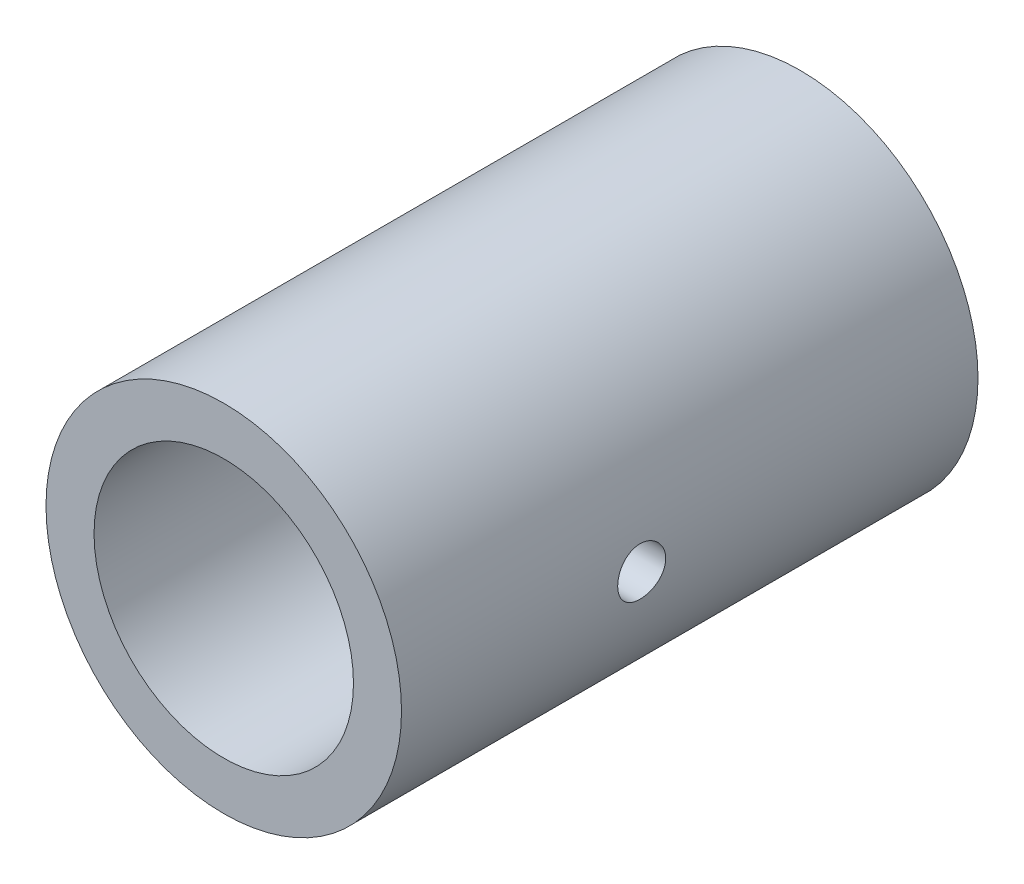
from build123d import *

# Parameters (mm, degrees)
SKETCH1_R               = 100
BOSS_EXTRUDE1_DEPTH     = 5
SKETCH2_R               = 18.5
SKETCH2_R_2             = 13.5
BOSS_EXTRUDE2_DEPTH     = 60
CUT_EXTRUDE1_REACH      = 193.638
CUT_EXTRUDE1_END_RADIUS = 13.5
SKETCH6_W               = 25
SKETCH6_H               = 30
FILLET1_R               = 10
SKETCH7_W               = 200
SKETCH7_H               = 5
CUT_EXTRUDE2_DEPTH      = 130
M6_TAPPED_HOLE1_REACH   = 79.047
M6_TAPPED_HOLE1_BORE_R  = 2.5


with BuildPart() as part:
    # Sketch1 → Boss-Extrude1 (new body)
    with BuildSketch(Plane.XY):
        Circle(SKETCH1_R)
    extrude(amount=BOSS_EXTRUDE1_DEPTH)

    # Sketch2 → Boss-Extrude2 (add)
    with BuildSketch(Plane.XY.offset(5)):
        Circle(SKETCH2_R)
        Circle(SKETCH2_R_2, mode=Mode.SUBTRACT)
    extrude(amount=BOSS_EXTRUDE2_DEPTH)

    # Cut-Extrude1: up to this cylinder (the profile starts outside it)
    cut_extrude1_end = Plane(origin=(0, 0, 20), z_dir=(0, 0, -1)) * Cylinder(CUT_EXTRUDE1_END_RADIUS, 415.276, mode=Mode.PRIVATE)
    # Sketch6 → Cut-Extrude1 (cut, up to the surface)
    with BuildSketch(Plane(origin=(0, -50, 0), x_dir=(1, 0, 0), z_dir=(0, 1, 0)), mode=Mode.PRIVATE) as cut_extrude1_sk1:
        with Locations((0, -20)):
            Rectangle(SKETCH6_W, SKETCH6_H)
    cut_extrude1_tool1 = extrude(cut_extrude1_sk1.sketch, amount=CUT_EXTRUDE1_REACH, mode=Mode.PRIVATE) - cut_extrude1_end
    add(cut_extrude1_tool1.solids().sort_by_distance((0, -50, 20))[0], mode=Mode.SUBTRACT)

    # Fillet1
    fillet1_edges = [part.edges().sort_by_distance(p)[0] for p in [
        (12.5, -9.368600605, 35),
        (-12.5, -9.368600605, 35),
    ]]
    fillet(fillet1_edges, radius=FILLET1_R)

    # Sketch7 → Cut-Extrude2 (cut, symmetric)
    with BuildSketch(Plane(origin=(0, 0, 0), x_dir=(1, 0, 0), z_dir=(0, 1, 0))):
        with Locations((0, -2.5)):
            Rectangle(SKETCH7_W, SKETCH7_H)
    extrude(amount=CUT_EXTRUDE2_DEPTH, both=True, mode=Mode.SUBTRACT)

    # M6 Tapped Hole1 bore → M6 Tapped Hole1 (cut, up to next)
    with BuildSketch(Plane(origin=(18.5, 0, 0), x_dir=(0, 0, -1), z_dir=(1, 0, 0)), mode=Mode.PRIVATE) as m6_tapped_hole1_sk1:
        with Locations((-40, 0)):
            Circle(M6_TAPPED_HOLE1_BORE_R)
    m6_tapped_hole1_tool1 = extrude(m6_tapped_hole1_sk1.sketch, amount=-M6_TAPPED_HOLE1_REACH, mode=Mode.PRIVATE) & part.part
    add(m6_tapped_hole1_tool1.solids().sort_by_distance((18.5, 0, 40))[0], mode=Mode.SUBTRACT)


solid = part.part
